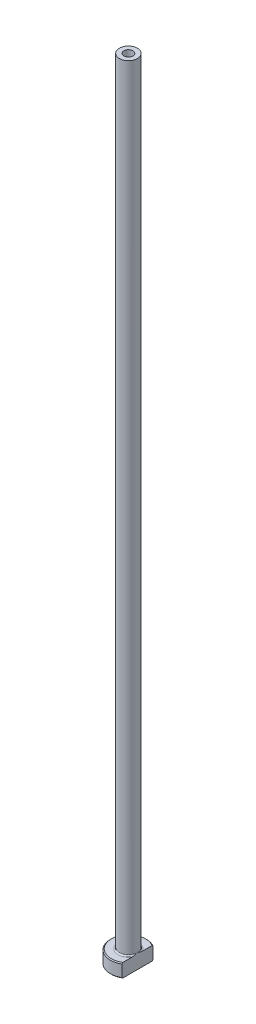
from build123d import *

# Parameters (mm, degrees)
FILLET1_R          = 0.3
CHAMFER1_SIZE      = 0.2
CUT_EXTRUDE1_DEPTH = 176.091404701
CHAMFER2_SIZE      = 0.5


with BuildPart() as part:
    # Sketch1 → Revolve1 (revolve)
    with BuildSketch(Plane.XY, mode=Mode.PRIVATE) as revolve1_sk:
        Polygon((-1, 175), (-2, 175), (-2, 3), (-4, 3), (-4, 0), (-1.25, 0), (-1.25, 128), (-1, 140), align=None)
    revolve(revolve1_sk.sketch.rotate(Axis((0, 92.187680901, 0), (0, -1, 0)), 270), axis=Axis((0, 92.187680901, 0), (0, -1, 0)))

    # Fillet1
    fillet1_edges = [part.edges().sort_by_distance(p)[0] for p in [
        (0, 3, -2),
    ]]
    fillet(fillet1_edges, radius=FILLET1_R)

    # Chamfer1
    chamfer1_edges = [part.edges().sort_by_distance(p)[0] for p in [
        (0, 0, -4),
        (0, 3, -4),
    ]]
    chamfer(chamfer1_edges, length=CHAMFER1_SIZE)

    # Sketch2 → Cut-Extrude1 (cut, through all)
    with BuildSketch(Plane.XZ):
        with BuildLine():
            Line((2, 3.464101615), (2, -3.464101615))
            ThreePointArc((2, -3.464101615), (4, 0), (2, 3.464101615))
        make_face()
    extrude(amount=-CUT_EXTRUDE1_DEPTH, mode=Mode.SUBTRACT)

    # Chamfer2
    chamfer2_edges = [part.edges().sort_by_distance(p)[0] for p in [
        (0, 0, -1.25),
    ]]
    chamfer(chamfer2_edges, length=CHAMFER2_SIZE)


solid = part.part
